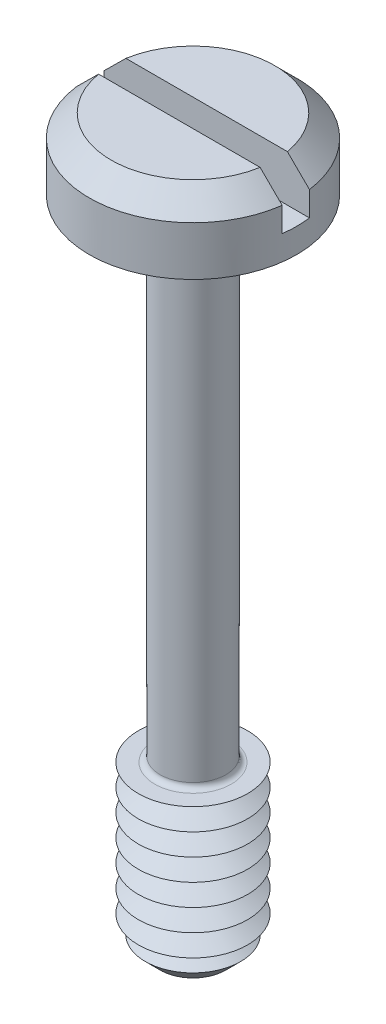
from build123d import *

# Parameters (mm, degrees)
SKETCH1_R           = 1.9
BOSS_EXTRUDE1_DEPTH = 1.3
SKETCH2_R           = 0.6
BOSS_EXTRUDE2_DEPTH = 12
SKETCH3_R           = 1
BOSS_EXTRUDE3_DEPTH = 3
CHAMFER1_SIZE       = 0.4
LPATTERN1_COUNT     = 7
LPATTERN1_PITCH     = 0.4
FILLET1_R           = 0.1
CHAMFER2_SIZE       = 0.4
SKETCH6_W           = 3.8
SKETCH6_H           = 0.5
CUT_EXTRUDE1_DEPTH  = 0.85


with BuildPart() as part:
    # Sketch1 → Boss-Extrude1 (new body)
    with BuildSketch(Plane(origin=(0, 0, 0), x_dir=(1, 0, 0), z_dir=(0, 1, 0))):
        with Locations(Location((0, 0, 0), (0, 0, 270))):
            Circle(SKETCH1_R)
    extrude(amount=BOSS_EXTRUDE1_DEPTH)

    # Sketch2 → Boss-Extrude2 (add)
    with BuildSketch(Plane.XZ):
        with Locations(Location((0, 0, 0), (0, 0, 270))):
            Circle(SKETCH2_R)
    extrude(amount=BOSS_EXTRUDE2_DEPTH)

    # Sketch3 → Boss-Extrude3 (add)
    with BuildSketch(Plane.XZ.offset(12)):
        with Locations(Location((0, 0, 0), (0, 0, 270))):
            Circle(SKETCH3_R)
    extrude(amount=-BOSS_EXTRUDE3_DEPTH)

    # Chamfer1
    chamfer1_edges = [part.edges().sort_by_distance(p)[0] for p in [
        (0, -12, 1),
    ]]
    chamfer(chamfer1_edges, length=CHAMFER1_SIZE)

    # Sketch5 → Cut-Revolve1 (revolve, cut)
    with BuildSketch(Plane(origin=(0, 0, 0), x_dir=(0, 0, -1), z_dir=(1, 0, 0))):
        Polygon((-1, -9), (-0.653589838, -9.2), (-1, -9.4), align=None)
    cut_revolve1 = revolve(axis=Axis((0, -6.58711856, 0), (0, -1, 0)), mode=Mode.SUBTRACT)

    # LPattern1: Cut-Revolve1 ×7
    with Locations(*[(0, -i * LPATTERN1_PITCH, 0) for i in range(1, LPATTERN1_COUNT)]):
        add(cut_revolve1, mode=Mode.SUBTRACT)

    # Fillet1
    fillet1_edges = [part.edges().sort_by_distance(p)[0] for p in [
        (0, 0, 0.6),
        (0, -9, 0.6),
    ]]
    fillet(fillet1_edges, radius=FILLET1_R)

    # Chamfer2
    chamfer2_edges = [part.edges().sort_by_distance(p)[0] for p in [
        (0, 1.3, -1.9),
    ]]
    chamfer(chamfer2_edges, length=CHAMFER2_SIZE)

    # Sketch6 → Cut-Extrude1 (cut)
    with BuildSketch(Plane(origin=(0, 1.3, 0), x_dir=(1, 0, 0), z_dir=(0, 1, 0))):
        Rectangle(SKETCH6_W, SKETCH6_H)
    extrude(amount=-CUT_EXTRUDE1_DEPTH, mode=Mode.SUBTRACT)


solid = part.part
